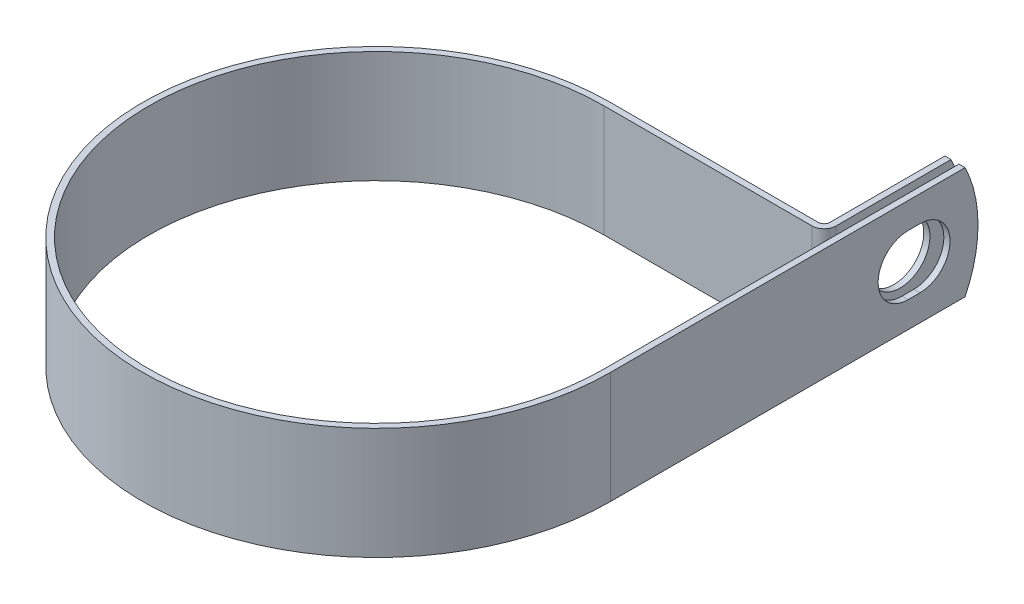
ISO-10303-21;
HEADER;
FILE_DESCRIPTION(('STEP AP214'),'2;1');
FILE_NAME('part.step','',(''),(''),'','','');
FILE_SCHEMA(('AUTOMOTIVE_DESIGN { 1 0 10303 214 1 1 1 1 }'));
ENDSEC;
DATA;
#1=APPLICATION_CONTEXT('core data for automotive mechanical design processes');
#2=APPLICATION_PROTOCOL_DEFINITION('international standard','automotive_design',2000,#1);
#3=PRODUCT_CONTEXT('',#1,'mechanical');
#4=PRODUCT('Part','Part','',(#3));
#5=PRODUCT_RELATED_PRODUCT_CATEGORY('part','',(#4));
#6=PRODUCT_DEFINITION_FORMATION('','',#4);
#7=PRODUCT_DEFINITION_CONTEXT('part definition',#1,'design');
#8=PRODUCT_DEFINITION('design','',#6,#7);
#9=PRODUCT_DEFINITION_SHAPE('','',#8);
#10=(LENGTH_UNIT() NAMED_UNIT(*) SI_UNIT(.MILLI.,.METRE.));
#11=(NAMED_UNIT(*) PLANE_ANGLE_UNIT() SI_UNIT($,.RADIAN.));
#12=(NAMED_UNIT(*) SI_UNIT($,.STERADIAN.) SOLID_ANGLE_UNIT());
#13=UNCERTAINTY_MEASURE_WITH_UNIT(LENGTH_MEASURE(1.E-05),#10,'distance_accuracy_value','');
#14=(GEOMETRIC_REPRESENTATION_CONTEXT(3) GLOBAL_UNCERTAINTY_ASSIGNED_CONTEXT((#13)) GLOBAL_UNIT_ASSIGNED_CONTEXT((#10,
#11,#12)) REPRESENTATION_CONTEXT('',''));
#15=CARTESIAN_POINT('',(0.,0.,0.));
#16=DIRECTION('',(0.,0.,1.));
#17=DIRECTION('',(1.,0.,0.));
#18=AXIS2_PLACEMENT_3D('',#15,#16,#17);
#19=CARTESIAN_POINT('',(45.2374,11.1125,0.));
#20=DIRECTION('',(-1.,0.,0.));
#21=DIRECTION('',(0.,0.,1.));
#22=AXIS2_PLACEMENT_3D('',#19,#20,#21);
#23=PLANE('',#22);
#24=DIRECTION('',(0.,0.,-1.));
#25=VECTOR('',#24,1.);
#26=CARTESIAN_POINT('',(45.2374,-5.9436,-59.1311999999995));
#27=LINE('',#26,#25);
#28=CARTESIAN_POINT('',(45.2374,-5.9436,-59.1311999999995));
#29=VERTEX_POINT('',#28);
#30=CARTESIAN_POINT('',(45.2374,-5.9436,-61.5188000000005));
#31=VERTEX_POINT('',#30);
#32=EDGE_CURVE('E236',#29,#31,#27,.T.);
#33=ORIENTED_EDGE('',*,*,#32,.T.);
#34=CARTESIAN_POINT('',(45.2374,0.,-61.5187999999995));
#35=DIRECTION('',(-1.,0.,0.));
#36=DIRECTION('',(0.,0.,1.));
#37=AXIS2_PLACEMENT_3D('',#34,#35,#36);
#38=CIRCLE('',#37,5.9436);
#39=CARTESIAN_POINT('',(45.2374,5.9436,-61.5188000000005));
#40=VERTEX_POINT('',#39);
#41=EDGE_CURVE('E257',#31,#40,#38,.F.);
#42=ORIENTED_EDGE('',*,*,#41,.T.);
#43=DIRECTION('',(0.,0.,1.));
#44=VECTOR('',#43,1.);
#45=CARTESIAN_POINT('',(45.2374,5.9436,-59.1311999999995));
#46=LINE('',#45,#44);
#47=CARTESIAN_POINT('',(45.2374,5.9436,-59.1311999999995));
#48=VERTEX_POINT('',#47);
#49=EDGE_CURVE('E253',#40,#48,#46,.T.);
#50=ORIENTED_EDGE('',*,*,#49,.T.);
#51=CARTESIAN_POINT('',(45.2374,0.,-59.1311999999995));
#52=DIRECTION('',(-1.,0.,0.));
#53=DIRECTION('',(0.,0.,1.));
#54=AXIS2_PLACEMENT_3D('',#51,#52,#53);
#55=CIRCLE('',#54,5.9436);
#56=EDGE_CURVE('E248',#48,#29,#55,.F.);
#57=ORIENTED_EDGE('',*,*,#56,.T.);
#58=EDGE_LOOP('',(#33,#42,#50,#57));
#59=FACE_BOUND('',#58,.T.);
#60=CARTESIAN_POINT('',(45.2374,0.,-47.625));
#61=DIRECTION('',(-1.,0.,0.));
#62=DIRECTION('',(0.,0.,1.));
#63=AXIS2_PLACEMENT_3D('',#60,#61,#62);
#64=CIRCLE('',#63,25.4);
#65=CARTESIAN_POINT('',(45.2374,11.1125,-70.4651476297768));
#66=VERTEX_POINT('',#65);
#67=CARTESIAN_POINT('',(45.2374,-11.1125,-70.4651476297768));
#68=VERTEX_POINT('',#67);
#69=EDGE_CURVE('E75',#66,#68,#64,.T.);
#70=ORIENTED_EDGE('',*,*,#69,.T.);
#71=DIRECTION('',(0.,0.,-1.));
#72=VECTOR('',#71,1.);
#73=CARTESIAN_POINT('',(45.2374,-11.1125,0.));
#74=LINE('',#73,#72);
#75=CARTESIAN_POINT('',(45.2374,-11.1125,0.));
#76=VERTEX_POINT('',#75);
#77=EDGE_CURVE('E271',#76,#68,#74,.T.);
#78=ORIENTED_EDGE('',*,*,#77,.F.);
#79=DIRECTION('',(0.,-1.,0.));
#80=VECTOR('',#79,1.);
#81=CARTESIAN_POINT('',(45.2374,11.1125,0.));
#82=LINE('',#81,#80);
#83=CARTESIAN_POINT('',(45.2374,11.1125,0.));
#84=VERTEX_POINT('',#83);
#85=EDGE_CURVE('E218',#84,#76,#82,.T.);
#86=ORIENTED_EDGE('',*,*,#85,.F.);
#87=DIRECTION('',(0.,0.,-1.));
#88=VECTOR('',#87,1.);
#89=CARTESIAN_POINT('',(45.2374,11.1125,-45.2374));
#90=LINE('',#89,#88);
#91=EDGE_CURVE('E273',#84,#66,#90,.T.);
#92=ORIENTED_EDGE('',*,*,#91,.T.);
#93=EDGE_LOOP('',(#70,#78,#86,#92));
#94=FACE_BOUND('',#93,.T.);
#95=ADVANCED_FACE('F54',(#59,#94),#23,.T.);
#96=CARTESIAN_POINT('',(43.6626,11.1125,-73.025));
#97=DIRECTION('',(1.,0.,0.));
#98=DIRECTION('',(0.,0.,-1.));
#99=AXIS2_PLACEMENT_3D('',#96,#97,#98);
#100=PLANE('',#99);
#101=CARTESIAN_POINT('',(43.6626,0.,-60.325));
#102=DIRECTION('',(1.,0.,0.));
#103=DIRECTION('',(0.,0.,-1.));
#104=AXIS2_PLACEMENT_3D('',#101,#102,#103);
#105=CIRCLE('',#104,5.9436);
#106=CARTESIAN_POINT('',(43.6626,0.,-66.2686));
#107=VERTEX_POINT('',#106);
#108=EDGE_CURVE('E268',#107,#107,#105,.F.);
#109=ORIENTED_EDGE('',*,*,#108,.T.);
#110=EDGE_LOOP('',(#109));
#111=FACE_BOUND('',#110,.T.);
#112=DIRECTION('',(0.,0.,1.));
#113=VECTOR('',#112,1.);
#114=CARTESIAN_POINT('',(43.6626,-11.1125,-73.025));
#115=LINE('',#114,#113);
#116=CARTESIAN_POINT('',(43.6626,-11.1125,-70.4651476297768));
#117=VERTEX_POINT('',#116);
#118=CARTESIAN_POINT('',(43.6626,-11.1125,-47.61484));
#119=VERTEX_POINT('',#118);
#120=EDGE_CURVE('E184',#117,#119,#115,.T.);
#121=ORIENTED_EDGE('',*,*,#120,.F.);
#122=CARTESIAN_POINT('',(43.6626,0.,-47.625));
#123=DIRECTION('',(1.,0.,0.));
#124=DIRECTION('',(0.,0.,-1.));
#125=AXIS2_PLACEMENT_3D('',#122,#123,#124);
#126=CIRCLE('',#125,25.4);
#127=CARTESIAN_POINT('',(43.6626,11.1125,-70.4651476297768));
#128=VERTEX_POINT('',#127);
#129=EDGE_CURVE('E176',#117,#128,#126,.T.);
#130=ORIENTED_EDGE('',*,*,#129,.T.);
#131=DIRECTION('',(0.,0.,1.));
#132=VECTOR('',#131,1.);
#133=CARTESIAN_POINT('',(43.6626,11.1125,-73.025));
#134=LINE('',#133,#132);
#135=CARTESIAN_POINT('',(43.6626,11.1125,-47.61484));
#136=VERTEX_POINT('',#135);
#137=EDGE_CURVE('E224',#128,#136,#134,.T.);
#138=ORIENTED_EDGE('',*,*,#137,.T.);
#139=DIRECTION('',(0.,-1.,0.));
#140=VECTOR('',#139,1.);
#141=CARTESIAN_POINT('',(43.6626,11.1125,-47.61484));
#142=LINE('',#141,#140);
#143=EDGE_CURVE('E211',#136,#119,#142,.T.);
#144=ORIENTED_EDGE('',*,*,#143,.T.);
#145=EDGE_LOOP('',(#121,#130,#138,#144));
#146=FACE_BOUND('',#145,.T.);
#147=ADVANCED_FACE('F226',(#111,#146),#100,.T.);
#148=CARTESIAN_POINT('',(42.4434,11.1125,-73.025));
#149=DIRECTION('',(1.,0.,0.));
#150=DIRECTION('',(0.,0.,-1.));
#151=AXIS2_PLACEMENT_3D('',#148,#149,#150);
#152=PLANE('',#151);
#153=CARTESIAN_POINT('',(42.4434,0.,-60.325));
#154=DIRECTION('',(-1.,0.,0.));
#155=DIRECTION('',(0.,0.,1.));
#156=AXIS2_PLACEMENT_3D('',#153,#154,#155);
#157=CIRCLE('',#156,5.9436);
#158=CARTESIAN_POINT('',(42.4434,0.,-54.3814));
#159=VERTEX_POINT('',#158);
#160=EDGE_CURVE('E265',#159,#159,#157,.T.);
#161=ORIENTED_EDGE('',*,*,#160,.F.);
#162=EDGE_LOOP('',(#161));
#163=FACE_BOUND('',#162,.T.);
#164=CARTESIAN_POINT('',(42.4434,0.,-47.625));
#165=DIRECTION('',(-1.,0.,0.));
#166=DIRECTION('',(0.,0.,1.));
#167=AXIS2_PLACEMENT_3D('',#164,#165,#166);
#168=CIRCLE('',#167,25.4);
#169=CARTESIAN_POINT('',(42.4434,11.1125,-70.4651476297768));
#170=VERTEX_POINT('',#169);
#171=CARTESIAN_POINT('',(42.4434,-11.1125,-70.4651476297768));
#172=VERTEX_POINT('',#171);
#173=EDGE_CURVE('E67',#170,#172,#168,.T.);
#174=ORIENTED_EDGE('',*,*,#173,.T.);
#175=DIRECTION('',(0.,0.,1.));
#176=VECTOR('',#175,1.);
#177=CARTESIAN_POINT('',(42.4434,-11.1125,-73.025));
#178=LINE('',#177,#176);
#179=CARTESIAN_POINT('',(42.4434,-11.1125,-47.61484));
#180=VERTEX_POINT('',#179);
#181=EDGE_CURVE('E167',#172,#180,#178,.T.);
#182=ORIENTED_EDGE('',*,*,#181,.T.);
#183=DIRECTION('',(0.,-1.,0.));
#184=VECTOR('',#183,1.);
#185=CARTESIAN_POINT('',(42.4434,11.1125,-47.61484));
#186=LINE('',#185,#184);
#187=CARTESIAN_POINT('',(42.4434,11.1125,-47.61484));
#188=VERTEX_POINT('',#187);
#189=EDGE_CURVE('E209',#188,#180,#186,.T.);
#190=ORIENTED_EDGE('',*,*,#189,.F.);
#191=DIRECTION('',(0.,0.,1.));
#192=VECTOR('',#191,1.);
#193=CARTESIAN_POINT('',(42.4434,11.1125,-73.025));
#194=LINE('',#193,#192);
#195=EDGE_CURVE('E169',#170,#188,#194,.T.);
#196=ORIENTED_EDGE('',*,*,#195,.F.);
#197=EDGE_LOOP('',(#174,#182,#190,#196));
#198=FACE_BOUND('',#197,.T.);
#199=ADVANCED_FACE('F164',(#163,#198),#152,.F.);
#200=CARTESIAN_POINT('',(46.4566,11.1125,0.));
#201=DIRECTION('',(-1.,0.,0.));
#202=DIRECTION('',(0.,0.,1.));
#203=AXIS2_PLACEMENT_3D('',#200,#201,#202);
#204=PLANE('',#203);
#205=CARTESIAN_POINT('',(46.4566,0.,-61.5187999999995));
#206=DIRECTION('',(1.,0.,0.));
#207=DIRECTION('',(0.,0.,-1.));
#208=AXIS2_PLACEMENT_3D('',#205,#206,#207);
#209=CIRCLE('',#208,5.9436);
#210=CARTESIAN_POINT('',(46.4566,-5.9436,-61.5188000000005));
#211=VERTEX_POINT('',#210);
#212=CARTESIAN_POINT('',(46.4566,5.9436,-61.5188000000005));
#213=VERTEX_POINT('',#212);
#214=EDGE_CURVE('E237',#211,#213,#209,.T.);
#215=ORIENTED_EDGE('',*,*,#214,.F.);
#216=DIRECTION('',(0.,0.,-1.));
#217=VECTOR('',#216,1.);
#218=CARTESIAN_POINT('',(46.4566,-5.9436,-59.1311999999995));
#219=LINE('',#218,#217);
#220=CARTESIAN_POINT('',(46.4566,-5.9436,-59.1311999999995));
#221=VERTEX_POINT('',#220);
#222=EDGE_CURVE('E240',#221,#211,#219,.T.);
#223=ORIENTED_EDGE('',*,*,#222,.F.);
#224=CARTESIAN_POINT('',(46.4566,0.,-59.1311999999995));
#225=DIRECTION('',(1.,0.,0.));
#226=DIRECTION('',(0.,0.,-1.));
#227=AXIS2_PLACEMENT_3D('',#224,#225,#226);
#228=CIRCLE('',#227,5.9436);
#229=CARTESIAN_POINT('',(46.4566,5.9436,-59.1311999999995));
#230=VERTEX_POINT('',#229);
#231=EDGE_CURVE('E230',#230,#221,#228,.T.);
#232=ORIENTED_EDGE('',*,*,#231,.F.);
#233=DIRECTION('',(0.,0.,1.));
#234=VECTOR('',#233,1.);
#235=CARTESIAN_POINT('',(46.4566,5.9436,-59.1311999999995));
#236=LINE('',#235,#234);
#237=EDGE_CURVE('E234',#213,#230,#236,.T.);
#238=ORIENTED_EDGE('',*,*,#237,.F.);
#239=EDGE_LOOP('',(#215,#223,#232,#238));
#240=FACE_BOUND('',#239,.T.);
#241=DIRECTION('',(0.,0.,-1.));
#242=VECTOR('',#241,1.);
#243=CARTESIAN_POINT('',(46.4566,-11.1125,0.));
#244=LINE('',#243,#242);
#245=CARTESIAN_POINT('',(46.4566,-11.1125,0.));
#246=VERTEX_POINT('',#245);
#247=CARTESIAN_POINT('',(46.4566,-11.1125,-70.4651476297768));
#248=VERTEX_POINT('',#247);
#249=EDGE_CURVE('E195',#246,#248,#244,.T.);
#250=ORIENTED_EDGE('',*,*,#249,.T.);
#251=CARTESIAN_POINT('',(46.4566,0.,-47.625));
#252=DIRECTION('',(-1.,0.,0.));
#253=DIRECTION('',(0.,0.,1.));
#254=AXIS2_PLACEMENT_3D('',#251,#252,#253);
#255=CIRCLE('',#254,25.4);
#256=CARTESIAN_POINT('',(46.4566,11.1125,-70.4651476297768));
#257=VERTEX_POINT('',#256);
#258=EDGE_CURVE('E170',#257,#248,#255,.T.);
#259=ORIENTED_EDGE('',*,*,#258,.F.);
#260=DIRECTION('',(0.,0.,-1.));
#261=VECTOR('',#260,1.);
#262=CARTESIAN_POINT('',(46.4566,11.1125,-45.2374));
#263=LINE('',#262,#261);
#264=CARTESIAN_POINT('',(46.4566,11.1125,0.));
#265=VERTEX_POINT('',#264);
#266=EDGE_CURVE('E198',#265,#257,#263,.T.);
#267=ORIENTED_EDGE('',*,*,#266,.F.);
#268=DIRECTION('',(0.,-1.,0.));
#269=VECTOR('',#268,1.);
#270=CARTESIAN_POINT('',(46.4566,11.1125,0.));
#271=LINE('',#270,#269);
#272=EDGE_CURVE('E199',#265,#246,#271,.T.);
#273=ORIENTED_EDGE('',*,*,#272,.T.);
#274=EDGE_LOOP('',(#250,#259,#267,#273));
#275=FACE_BOUND('',#274,.T.);
#276=ADVANCED_FACE('F321',(#240,#275),#204,.F.);
#277=CARTESIAN_POINT('',(0.,-11.1125,0.));
#278=DIRECTION('',(0.,1.,0.));
#279=DIRECTION('',(1.,0.,0.));
#280=AXIS2_PLACEMENT_3D('',#277,#278,#279);
#281=PLANE('',#280);
#282=DIRECTION('',(-1.,0.,0.));
#283=VECTOR('',#282,1.);
#284=CARTESIAN_POINT('',(46.4566,-11.1125,-70.4651476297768));
#285=LINE('',#284,#283);
#286=EDGE_CURVE('E171',#248,#68,#285,.T.);
#287=ORIENTED_EDGE('',*,*,#286,.F.);
#288=ORIENTED_EDGE('',*,*,#249,.F.);
#289=CARTESIAN_POINT('',(0.,-11.1125,0.));
#290=DIRECTION('',(0.,1.,0.));
#291=DIRECTION('',(1.,0.,0.));
#292=AXIS2_PLACEMENT_3D('',#289,#290,#291);
#293=CIRCLE('',#292,46.4566);
#294=CARTESIAN_POINT('',(0.,-11.1125,-46.4566));
#295=VERTEX_POINT('',#294);
#296=EDGE_CURVE('E193',#295,#246,#293,.T.);
#297=ORIENTED_EDGE('',*,*,#296,.F.);
#298=DIRECTION('',(1.,0.,0.));
#299=VECTOR('',#298,1.);
#300=CARTESIAN_POINT('',(0.,-11.1125,-46.4566));
#301=LINE('',#300,#299);
#302=CARTESIAN_POINT('',(41.28516,-11.1125,-46.4566));
#303=VERTEX_POINT('',#302);
#304=EDGE_CURVE('E186',#303,#295,#301,.F.);
#305=ORIENTED_EDGE('',*,*,#304,.F.);
#306=CARTESIAN_POINT('',(41.28516,-11.1125,-47.61484));
#307=DIRECTION('',(0.,1.,0.));
#308=DIRECTION('',(1.,0.,0.));
#309=AXIS2_PLACEMENT_3D('',#306,#307,#308);
#310=CIRCLE('',#309,1.15824000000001);
#311=EDGE_CURVE('E183',#180,#303,#310,.F.);
#312=ORIENTED_EDGE('',*,*,#311,.F.);
#313=ORIENTED_EDGE('',*,*,#181,.F.);
#314=DIRECTION('',(-1.,0.,0.));
#315=VECTOR('',#314,1.);
#316=CARTESIAN_POINT('',(46.4566,-11.1125,-70.4651476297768));
#317=LINE('',#316,#315);
#318=EDGE_CURVE('E12',#117,#172,#317,.T.);
#319=ORIENTED_EDGE('',*,*,#318,.F.);
#320=ORIENTED_EDGE('',*,*,#120,.T.);
#321=CARTESIAN_POINT('',(41.28516,-11.1125,-47.61484));
#322=DIRECTION('',(0.,-1.,0.));
#323=DIRECTION('',(0.,0.,1.));
#324=AXIS2_PLACEMENT_3D('',#321,#322,#323);
#325=CIRCLE('',#324,2.37744);
#326=CARTESIAN_POINT('',(41.28516,-11.1125,-45.2374));
#327=VERTEX_POINT('',#326);
#328=EDGE_CURVE('E188',#119,#327,#325,.T.);
#329=ORIENTED_EDGE('',*,*,#328,.T.);
#330=DIRECTION('',(-1.,0.,0.));
#331=VECTOR('',#330,1.);
#332=CARTESIAN_POINT('',(0.,-11.1125,-45.2374));
#333=LINE('',#332,#331);
#334=CARTESIAN_POINT('',(0.,-11.1125,-45.2374));
#335=VERTEX_POINT('',#334);
#336=EDGE_CURVE('E298',#327,#335,#333,.T.);
#337=ORIENTED_EDGE('',*,*,#336,.T.);
#338=CARTESIAN_POINT('',(0.,-11.1125,0.));
#339=DIRECTION('',(0.,1.,0.));
#340=DIRECTION('',(0.,0.,1.));
#341=AXIS2_PLACEMENT_3D('',#338,#339,#340);
#342=CIRCLE('',#341,45.2374);
#343=EDGE_CURVE('E295',#335,#76,#342,.T.);
#344=ORIENTED_EDGE('',*,*,#343,.T.);
#345=ORIENTED_EDGE('',*,*,#77,.T.);
#346=EDGE_LOOP('',(#287,#288,#297,#305,#312,#313,#319,#320,#329,#337,#344,#345));
#347=FACE_BOUND('',#346,.T.);
#348=ADVANCED_FACE('F181',(#347),#281,.F.);
#349=CARTESIAN_POINT('',(0.,11.1125,0.));
#350=DIRECTION('',(0.,1.,0.));
#351=DIRECTION('',(1.,0.,0.));
#352=AXIS2_PLACEMENT_3D('',#349,#350,#351);
#353=PLANE('',#352);
#354=ORIENTED_EDGE('',*,*,#266,.T.);
#355=DIRECTION('',(-1.,0.,0.));
#356=VECTOR('',#355,1.);
#357=CARTESIAN_POINT('',(46.4566,11.1125,-70.4651476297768));
#358=LINE('',#357,#356);
#359=EDGE_CURVE('E228',#257,#66,#358,.T.);
#360=ORIENTED_EDGE('',*,*,#359,.T.);
#361=ORIENTED_EDGE('',*,*,#91,.F.);
#362=CARTESIAN_POINT('',(0.,11.1125,0.));
#363=DIRECTION('',(0.,1.,0.));
#364=DIRECTION('',(0.,0.,1.));
#365=AXIS2_PLACEMENT_3D('',#362,#363,#364);
#366=CIRCLE('',#365,45.2374);
#367=CARTESIAN_POINT('',(0.,11.1125,-45.2374));
#368=VERTEX_POINT('',#367);
#369=EDGE_CURVE('E276',#368,#84,#366,.T.);
#370=ORIENTED_EDGE('',*,*,#369,.F.);
#371=DIRECTION('',(-1.,0.,0.));
#372=VECTOR('',#371,1.);
#373=CARTESIAN_POINT('',(0.,11.1125,-45.2374));
#374=LINE('',#373,#372);
#375=CARTESIAN_POINT('',(41.28516,11.1125,-45.2374));
#376=VERTEX_POINT('',#375);
#377=EDGE_CURVE('E279',#376,#368,#374,.T.);
#378=ORIENTED_EDGE('',*,*,#377,.F.);
#379=CARTESIAN_POINT('',(41.28516,11.1125,-47.61484));
#380=DIRECTION('',(0.,-1.,0.));
#381=DIRECTION('',(0.,0.,1.));
#382=AXIS2_PLACEMENT_3D('',#379,#380,#381);
#383=CIRCLE('',#382,2.37744);
#384=EDGE_CURVE('E282',#136,#376,#383,.T.);
#385=ORIENTED_EDGE('',*,*,#384,.F.);
#386=ORIENTED_EDGE('',*,*,#137,.F.);
#387=DIRECTION('',(-1.,0.,0.));
#388=VECTOR('',#387,1.);
#389=CARTESIAN_POINT('',(46.4566,11.1125,-70.4651476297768));
#390=LINE('',#389,#388);
#391=EDGE_CURVE('E61',#128,#170,#390,.T.);
#392=ORIENTED_EDGE('',*,*,#391,.T.);
#393=ORIENTED_EDGE('',*,*,#195,.T.);
#394=CARTESIAN_POINT('',(41.28516,11.1125,-47.61484));
#395=DIRECTION('',(0.,1.,0.));
#396=DIRECTION('',(1.,0.,0.));
#397=AXIS2_PLACEMENT_3D('',#394,#395,#396);
#398=CIRCLE('',#397,1.15824000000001);
#399=CARTESIAN_POINT('',(41.28516,11.1125,-46.4566));
#400=VERTEX_POINT('',#399);
#401=EDGE_CURVE('E287',#188,#400,#398,.F.);
#402=ORIENTED_EDGE('',*,*,#401,.T.);
#403=DIRECTION('',(1.,0.,0.));
#404=VECTOR('',#403,1.);
#405=CARTESIAN_POINT('',(0.,11.1125,-46.4566));
#406=LINE('',#405,#404);
#407=CARTESIAN_POINT('',(0.,11.1125,-46.4566));
#408=VERTEX_POINT('',#407);
#409=EDGE_CURVE('E289',#400,#408,#406,.F.);
#410=ORIENTED_EDGE('',*,*,#409,.T.);
#411=CARTESIAN_POINT('',(0.,11.1125,0.));
#412=DIRECTION('',(0.,1.,0.));
#413=DIRECTION('',(1.,0.,0.));
#414=AXIS2_PLACEMENT_3D('',#411,#412,#413);
#415=CIRCLE('',#414,46.4566);
#416=EDGE_CURVE('E203',#408,#265,#415,.T.);
#417=ORIENTED_EDGE('',*,*,#416,.T.);
#418=EDGE_LOOP('',(#354,#360,#361,#370,#378,#385,#386,#392,#393,#402,#410,#417));
#419=FACE_BOUND('',#418,.T.);
#420=ADVANCED_FACE('F222',(#419),#353,.T.);
#421=CARTESIAN_POINT('',(0.,11.1125,0.));
#422=DIRECTION('',(0.,-1.,0.));
#423=DIRECTION('',(0.,0.,-1.));
#424=AXIS2_PLACEMENT_3D('',#421,#422,#423);
#425=CYLINDRICAL_SURFACE('',#424,45.2374);
#426=ORIENTED_EDGE('',*,*,#343,.F.);
#427=DIRECTION('',(0.,-1.,0.));
#428=VECTOR('',#427,1.);
#429=CARTESIAN_POINT('',(0.,11.1125,-45.2374));
#430=LINE('',#429,#428);
#431=EDGE_CURVE('E216',#368,#335,#430,.T.);
#432=ORIENTED_EDGE('',*,*,#431,.F.);
#433=ORIENTED_EDGE('',*,*,#369,.T.);
#434=ORIENTED_EDGE('',*,*,#85,.T.);
#435=EDGE_LOOP('',(#426,#432,#433,#434));
#436=FACE_BOUND('',#435,.T.);
#437=ADVANCED_FACE('F311',(#436),#425,.F.);
#438=CARTESIAN_POINT('',(0.,11.1125,-45.2374));
#439=DIRECTION('',(0.,0.,1.));
#440=DIRECTION('',(1.,0.,0.));
#441=AXIS2_PLACEMENT_3D('',#438,#439,#440);
#442=PLANE('',#441);
#443=ORIENTED_EDGE('',*,*,#336,.F.);
#444=DIRECTION('',(0.,-1.,0.));
#445=VECTOR('',#444,1.);
#446=CARTESIAN_POINT('',(41.28516,11.1125,-45.2374));
#447=LINE('',#446,#445);
#448=EDGE_CURVE('E214',#376,#327,#447,.T.);
#449=ORIENTED_EDGE('',*,*,#448,.F.);
#450=ORIENTED_EDGE('',*,*,#377,.T.);
#451=ORIENTED_EDGE('',*,*,#431,.T.);
#452=EDGE_LOOP('',(#443,#449,#450,#451));
#453=FACE_BOUND('',#452,.T.);
#454=ADVANCED_FACE('F307',(#453),#442,.T.);
#455=CARTESIAN_POINT('',(41.28516,11.1125,-47.61484));
#456=DIRECTION('',(0.,-1.,0.));
#457=DIRECTION('',(0.,0.,-1.));
#458=AXIS2_PLACEMENT_3D('',#455,#456,#457);
#459=CYLINDRICAL_SURFACE('',#458,2.37744);
#460=ORIENTED_EDGE('',*,*,#328,.F.);
#461=ORIENTED_EDGE('',*,*,#143,.F.);
#462=ORIENTED_EDGE('',*,*,#384,.T.);
#463=ORIENTED_EDGE('',*,*,#448,.T.);
#464=EDGE_LOOP('',(#460,#461,#462,#463));
#465=FACE_BOUND('',#464,.T.);
#466=ADVANCED_FACE('F304',(#465),#459,.T.);
#467=CARTESIAN_POINT('',(41.28516,11.1125,-47.61484));
#468=DIRECTION('',(0.,-1.,0.));
#469=DIRECTION('',(0.,0.,-1.));
#470=AXIS2_PLACEMENT_3D('',#467,#468,#469);
#471=CYLINDRICAL_SURFACE('',#470,1.15824000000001);
#472=ORIENTED_EDGE('',*,*,#311,.T.);
#473=DIRECTION('',(0.,-1.,0.));
#474=VECTOR('',#473,1.);
#475=CARTESIAN_POINT('',(41.28516,11.1125,-46.4566));
#476=LINE('',#475,#474);
#477=EDGE_CURVE('E206',#400,#303,#476,.T.);
#478=ORIENTED_EDGE('',*,*,#477,.F.);
#479=ORIENTED_EDGE('',*,*,#401,.F.);
#480=ORIENTED_EDGE('',*,*,#189,.T.);
#481=EDGE_LOOP('',(#472,#478,#479,#480));
#482=FACE_BOUND('',#481,.T.);
#483=ADVANCED_FACE('F334',(#482),#471,.F.);
#484=CARTESIAN_POINT('',(0.,11.1125,-46.4566));
#485=DIRECTION('',(0.,0.,1.));
#486=DIRECTION('',(1.,0.,0.));
#487=AXIS2_PLACEMENT_3D('',#484,#485,#486);
#488=PLANE('',#487);
#489=ORIENTED_EDGE('',*,*,#304,.T.);
#490=DIRECTION('',(0.,-1.,0.));
#491=VECTOR('',#490,1.);
#492=CARTESIAN_POINT('',(0.,11.1125,-46.4566));
#493=LINE('',#492,#491);
#494=EDGE_CURVE('E202',#408,#295,#493,.T.);
#495=ORIENTED_EDGE('',*,*,#494,.F.);
#496=ORIENTED_EDGE('',*,*,#409,.F.);
#497=ORIENTED_EDGE('',*,*,#477,.T.);
#498=EDGE_LOOP('',(#489,#495,#496,#497));
#499=FACE_BOUND('',#498,.T.);
#500=ADVANCED_FACE('F330',(#499),#488,.F.);
#501=CARTESIAN_POINT('',(0.,11.1125,0.));
#502=DIRECTION('',(0.,-1.,0.));
#503=DIRECTION('',(0.,0.,-1.));
#504=AXIS2_PLACEMENT_3D('',#501,#502,#503);
#505=CYLINDRICAL_SURFACE('',#504,46.4566);
#506=ORIENTED_EDGE('',*,*,#296,.T.);
#507=ORIENTED_EDGE('',*,*,#272,.F.);
#508=ORIENTED_EDGE('',*,*,#416,.F.);
#509=ORIENTED_EDGE('',*,*,#494,.T.);
#510=EDGE_LOOP('',(#506,#507,#508,#509));
#511=FACE_BOUND('',#510,.T.);
#512=ADVANCED_FACE('F327',(#511),#505,.T.);
#513=CARTESIAN_POINT('',(60.4736394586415,0.,-60.325));
#514=DIRECTION('',(-1.,0.,0.));
#515=DIRECTION('',(0.,0.,1.));
#516=AXIS2_PLACEMENT_3D('',#513,#514,#515);
#517=CYLINDRICAL_SURFACE('',#516,5.9436);
#518=ORIENTED_EDGE('',*,*,#160,.T.);
#519=EDGE_LOOP('',(#518));
#520=FACE_BOUND('',#519,.T.);
#521=ORIENTED_EDGE('',*,*,#108,.F.);
#522=EDGE_LOOP('',(#521));
#523=FACE_BOUND('',#522,.T.);
#524=ADVANCED_FACE('F379',(#520,#523),#517,.F.);
#525=CARTESIAN_POINT('',(26.6611937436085,-5.9436,-59.1311999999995));
#526=DIRECTION('',(0.,-1.,0.));
#527=DIRECTION('',(0.,0.,-1.));
#528=AXIS2_PLACEMENT_3D('',#525,#526,#527);
#529=PLANE('',#528);
#530=DIRECTION('',(1.,0.,0.));
#531=VECTOR('',#530,1.);
#532=CARTESIAN_POINT('',(26.6611937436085,-5.9436,-59.1311999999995));
#533=LINE('',#532,#531);
#534=EDGE_CURVE('E251',#29,#221,#533,.T.);
#535=ORIENTED_EDGE('',*,*,#534,.T.);
#536=ORIENTED_EDGE('',*,*,#222,.T.);
#537=DIRECTION('',(1.,0.,0.));
#538=VECTOR('',#537,1.);
#539=CARTESIAN_POINT('',(26.6611937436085,-5.9436,-61.5188000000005));
#540=LINE('',#539,#538);
#541=EDGE_CURVE('E247',#31,#211,#540,.T.);
#542=ORIENTED_EDGE('',*,*,#541,.F.);
#543=ORIENTED_EDGE('',*,*,#32,.F.);
#544=EDGE_LOOP('',(#535,#536,#542,#543));
#545=FACE_BOUND('',#544,.T.);
#546=ADVANCED_FACE('F354',(#545),#529,.F.);
#547=CARTESIAN_POINT('',(26.6611937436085,0.,-61.5187999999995));
#548=DIRECTION('',(1.,0.,0.));
#549=DIRECTION('',(0.,0.,-1.));
#550=AXIS2_PLACEMENT_3D('',#547,#548,#549);
#551=CYLINDRICAL_SURFACE('',#550,5.9436);
#552=ORIENTED_EDGE('',*,*,#541,.T.);
#553=ORIENTED_EDGE('',*,*,#214,.T.);
#554=DIRECTION('',(1.,0.,0.));
#555=VECTOR('',#554,1.);
#556=CARTESIAN_POINT('',(26.6611937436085,5.9436,-61.5188000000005));
#557=LINE('',#556,#555);
#558=EDGE_CURVE('E256',#40,#213,#557,.T.);
#559=ORIENTED_EDGE('',*,*,#558,.F.);
#560=ORIENTED_EDGE('',*,*,#41,.F.);
#561=EDGE_LOOP('',(#552,#553,#559,#560));
#562=FACE_BOUND('',#561,.T.);
#563=ADVANCED_FACE('F358',(#562),#551,.F.);
#564=CARTESIAN_POINT('',(26.6611937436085,5.9436,-59.1311999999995));
#565=DIRECTION('',(0.,1.,0.));
#566=DIRECTION('',(0.,0.,1.));
#567=AXIS2_PLACEMENT_3D('',#564,#565,#566);
#568=PLANE('',#567);
#569=ORIENTED_EDGE('',*,*,#558,.T.);
#570=ORIENTED_EDGE('',*,*,#237,.T.);
#571=DIRECTION('',(1.,0.,0.));
#572=VECTOR('',#571,1.);
#573=CARTESIAN_POINT('',(26.6611937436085,5.9436,-59.1311999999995));
#574=LINE('',#573,#572);
#575=EDGE_CURVE('E252',#48,#230,#574,.T.);
#576=ORIENTED_EDGE('',*,*,#575,.F.);
#577=ORIENTED_EDGE('',*,*,#49,.F.);
#578=EDGE_LOOP('',(#569,#570,#576,#577));
#579=FACE_BOUND('',#578,.T.);
#580=ADVANCED_FACE('F362',(#579),#568,.F.);
#581=CARTESIAN_POINT('',(26.6611937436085,0.,-59.1311999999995));
#582=DIRECTION('',(1.,0.,0.));
#583=DIRECTION('',(0.,0.,-1.));
#584=AXIS2_PLACEMENT_3D('',#581,#582,#583);
#585=CYLINDRICAL_SURFACE('',#584,5.9436);
#586=ORIENTED_EDGE('',*,*,#575,.T.);
#587=ORIENTED_EDGE('',*,*,#231,.T.);
#588=ORIENTED_EDGE('',*,*,#534,.F.);
#589=ORIENTED_EDGE('',*,*,#56,.F.);
#590=EDGE_LOOP('',(#586,#587,#588,#589));
#591=FACE_BOUND('',#590,.T.);
#592=ADVANCED_FACE('F366',(#591),#585,.F.);
#593=CARTESIAN_POINT('',(46.4566,0.,-47.625));
#594=DIRECTION('',(-1.,0.,0.));
#595=DIRECTION('',(0.,0.,1.));
#596=AXIS2_PLACEMENT_3D('',#593,#594,#595);
#597=CYLINDRICAL_SURFACE('',#596,25.4);
#598=ORIENTED_EDGE('',*,*,#129,.F.);
#599=ORIENTED_EDGE('',*,*,#318,.T.);
#600=ORIENTED_EDGE('',*,*,#173,.F.);
#601=ORIENTED_EDGE('',*,*,#391,.F.);
#602=EDGE_LOOP('',(#598,#599,#600,#601));
#603=FACE_BOUND('',#602,.T.);
#604=ADVANCED_FACE('F174',(#603),#597,.T.);
#605=ORIENTED_EDGE('',*,*,#359,.F.);
#606=ORIENTED_EDGE('',*,*,#258,.T.);
#607=ORIENTED_EDGE('',*,*,#286,.T.);
#608=ORIENTED_EDGE('',*,*,#69,.F.);
#609=EDGE_LOOP('',(#605,#606,#607,#608));
#610=FACE_BOUND('',#609,.T.);
#611=ADVANCED_FACE('F316',(#610),#597,.T.);
#612=CLOSED_SHELL('',(#95,#147,#199,#276,#348,#420,#437,#454,#466,#483,#500,#512,#524,#546,#563,
#580,#592,#604,#611));
#613=MANIFOLD_SOLID_BREP('B2',#612);
#614=ADVANCED_BREP_SHAPE_REPRESENTATION('',(#18,#613),#14);
#615=SHAPE_DEFINITION_REPRESENTATION(#9,#614);
ENDSEC;
END-ISO-10303-21;
